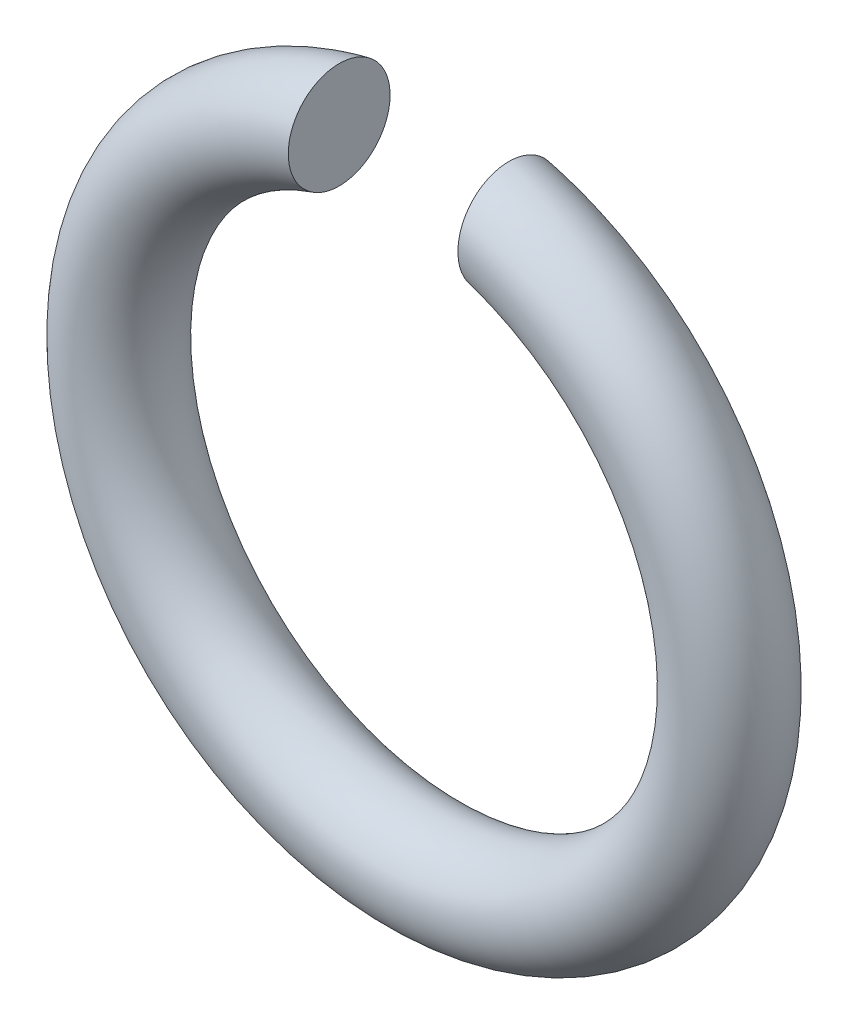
from build123d import *

# Parameters (mm, degrees)
SKETCH2_R               = 0.3
CUT_EXTRUDE1_DEPTH      = 3.984962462
CUT_EXTRUDE1_DEPTH_BACK = 3.984962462
SKETCH3_W               = 1
SKETCH3_H               = 2.1


with BuildPart() as part:
    # Base-Sweep: sweep along a path in Sketch1
    with BuildLine(Plane.XY) as base_sweep_path:
        CenterArc((0, 0), 1.8, 0, 360)
    # Sketch2 → Base-Sweep (sweep)
    with BuildSketch(Plane(origin=(0, 0, 0), x_dir=(1, 0, 0), z_dir=(0, 1, 0))):
        with Locations((1.8, 0)):
            Circle(SKETCH2_R)
    sweep(path=base_sweep_path.line)

    # Sketch3 → Cut-Extrude1 (cut, two sides: drawn at the far end of the back side and taken through both)
    with BuildSketch(Plane.XY.offset(-CUT_EXTRUDE1_DEPTH_BACK)):
        with Locations((0, 1.05)):
            Rectangle(SKETCH3_W, SKETCH3_H)
    extrude(amount=CUT_EXTRUDE1_DEPTH + CUT_EXTRUDE1_DEPTH_BACK, mode=Mode.SUBTRACT)


solid = part.part
